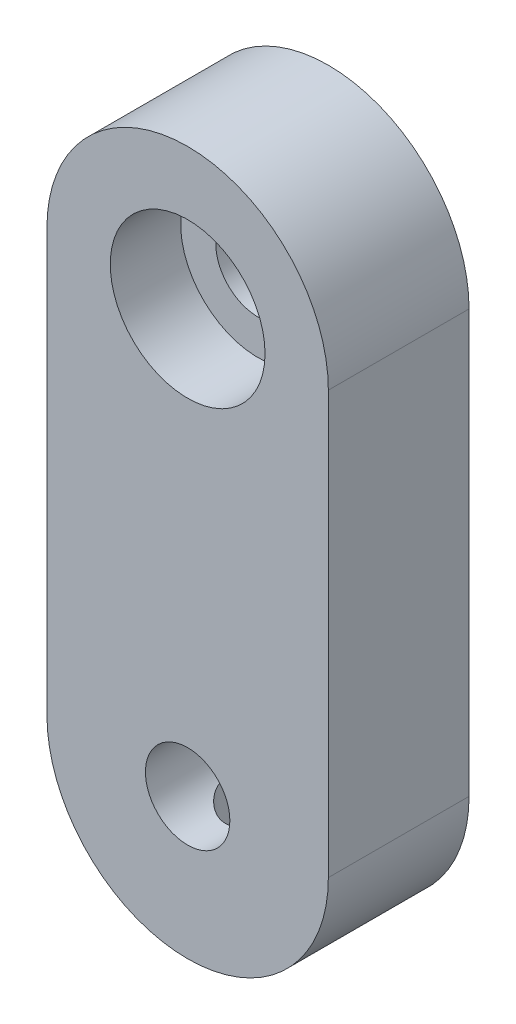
ISO-10303-21;
HEADER;
FILE_DESCRIPTION(('STEP AP214'),'2;1');
FILE_NAME('part.step','',(''),(''),'','','');
FILE_SCHEMA(('AUTOMOTIVE_DESIGN { 1 0 10303 214 1 1 1 1 }'));
ENDSEC;
DATA;
#1=APPLICATION_CONTEXT('core data for automotive mechanical design processes');
#2=APPLICATION_PROTOCOL_DEFINITION('international standard','automotive_design',2000,#1);
#3=PRODUCT_CONTEXT('',#1,'mechanical');
#4=PRODUCT('Part','Part','',(#3));
#5=PRODUCT_RELATED_PRODUCT_CATEGORY('part','',(#4));
#6=PRODUCT_DEFINITION_FORMATION('','',#4);
#7=PRODUCT_DEFINITION_CONTEXT('part definition',#1,'design');
#8=PRODUCT_DEFINITION('design','',#6,#7);
#9=PRODUCT_DEFINITION_SHAPE('','',#8);
#10=(LENGTH_UNIT() NAMED_UNIT(*) SI_UNIT(.MILLI.,.METRE.));
#11=(NAMED_UNIT(*) PLANE_ANGLE_UNIT() SI_UNIT($,.RADIAN.));
#12=(NAMED_UNIT(*) SI_UNIT($,.STERADIAN.) SOLID_ANGLE_UNIT());
#13=UNCERTAINTY_MEASURE_WITH_UNIT(LENGTH_MEASURE(1.E-05),#10,'distance_accuracy_value','');
#14=(GEOMETRIC_REPRESENTATION_CONTEXT(3) GLOBAL_UNCERTAINTY_ASSIGNED_CONTEXT((#13)) GLOBAL_UNIT_ASSIGNED_CONTEXT((#10,
#11,#12)) REPRESENTATION_CONTEXT('',''));
#15=CARTESIAN_POINT('',(0.,0.,0.));
#16=DIRECTION('',(0.,0.,1.));
#17=DIRECTION('',(1.,0.,0.));
#18=AXIS2_PLACEMENT_3D('',#15,#16,#17);
#19=CARTESIAN_POINT('',(0.,30.,10.));
#20=DIRECTION('',(0.,0.,-1.));
#21=DIRECTION('',(-1.,0.,0.));
#22=AXIS2_PLACEMENT_3D('',#19,#20,#21);
#23=CYLINDRICAL_SURFACE('',#22,3.);
#24=CARTESIAN_POINT('',(0.,30.,0.));
#25=DIRECTION('',(0.,0.,1.));
#26=DIRECTION('',(1.,0.,0.));
#27=AXIS2_PLACEMENT_3D('',#24,#25,#26);
#28=CIRCLE('',#27,3.);
#29=CARTESIAN_POINT('',(3.,30.,0.));
#30=VERTEX_POINT('',#29);
#31=EDGE_CURVE('E103',#30,#30,#28,.T.);
#32=ORIENTED_EDGE('',*,*,#31,.F.);
#33=EDGE_LOOP('',(#32));
#34=FACE_BOUND('',#33,.T.);
#35=CARTESIAN_POINT('',(0.,30.,5.));
#36=DIRECTION('',(0.,0.,1.));
#37=DIRECTION('',(1.,0.,0.));
#38=AXIS2_PLACEMENT_3D('',#35,#36,#37);
#39=CIRCLE('',#38,3.);
#40=CARTESIAN_POINT('',(3.,30.,5.));
#41=VERTEX_POINT('',#40);
#42=EDGE_CURVE('E36',#41,#41,#39,.T.);
#43=ORIENTED_EDGE('',*,*,#42,.T.);
#44=EDGE_LOOP('',(#43));
#45=FACE_BOUND('',#44,.T.);
#46=ADVANCED_FACE('F31',(#34,#45),#23,.F.);
#47=CARTESIAN_POINT('',(0.,0.,10.));
#48=DIRECTION('',(0.,0.,1.));
#49=DIRECTION('',(1.,0.,0.));
#50=AXIS2_PLACEMENT_3D('',#47,#48,#49);
#51=PLANE('',#50);
#52=CARTESIAN_POINT('',(0.,30.,10.));
#53=DIRECTION('',(0.,0.,1.));
#54=DIRECTION('',(1.,0.,0.));
#55=AXIS2_PLACEMENT_3D('',#52,#53,#54);
#56=CIRCLE('',#55,5.5);
#57=CARTESIAN_POINT('',(5.5,30.,10.));
#58=VERTEX_POINT('',#57);
#59=EDGE_CURVE('E133',#58,#58,#56,.T.);
#60=ORIENTED_EDGE('',*,*,#59,.F.);
#61=EDGE_LOOP('',(#60));
#62=FACE_BOUND('',#61,.T.);
#63=CARTESIAN_POINT('',(0.,0.,10.));
#64=DIRECTION('',(0.,0.,1.));
#65=DIRECTION('',(1.,0.,0.));
#66=AXIS2_PLACEMENT_3D('',#63,#64,#65);
#67=CIRCLE('',#66,10.);
#68=CARTESIAN_POINT('',(-10.,0.,10.));
#69=VERTEX_POINT('',#68);
#70=CARTESIAN_POINT('',(10.,0.,10.));
#71=VERTEX_POINT('',#70);
#72=EDGE_CURVE('E87',#69,#71,#67,.T.);
#73=ORIENTED_EDGE('',*,*,#72,.T.);
#74=DIRECTION('',(0.,1.,0.));
#75=VECTOR('',#74,1.);
#76=CARTESIAN_POINT('',(10.,0.,10.));
#77=LINE('',#76,#75);
#78=CARTESIAN_POINT('',(10.,30.,10.));
#79=VERTEX_POINT('',#78);
#80=EDGE_CURVE('E81',#71,#79,#77,.T.);
#81=ORIENTED_EDGE('',*,*,#80,.T.);
#82=CARTESIAN_POINT('',(0.,30.,10.));
#83=DIRECTION('',(0.,0.,1.));
#84=DIRECTION('',(1.,0.,0.));
#85=AXIS2_PLACEMENT_3D('',#82,#83,#84);
#86=CIRCLE('',#85,10.);
#87=CARTESIAN_POINT('',(-10.,30.,10.));
#88=VERTEX_POINT('',#87);
#89=EDGE_CURVE('E85',#79,#88,#86,.T.);
#90=ORIENTED_EDGE('',*,*,#89,.T.);
#91=DIRECTION('',(0.,-1.,0.));
#92=VECTOR('',#91,1.);
#93=CARTESIAN_POINT('',(-10.,0.,10.));
#94=LINE('',#93,#92);
#95=EDGE_CURVE('E51',#88,#69,#94,.T.);
#96=ORIENTED_EDGE('',*,*,#95,.T.);
#97=EDGE_LOOP('',(#73,#81,#90,#96));
#98=FACE_BOUND('',#97,.T.);
#99=CARTESIAN_POINT('',(0.,0.,10.));
#100=DIRECTION('',(0.,0.,1.));
#101=DIRECTION('',(1.,0.,0.));
#102=AXIS2_PLACEMENT_3D('',#99,#100,#101);
#103=CIRCLE('',#102,3.);
#104=CARTESIAN_POINT('',(3.,0.,10.));
#105=VERTEX_POINT('',#104);
#106=EDGE_CURVE('E135',#105,#105,#103,.T.);
#107=ORIENTED_EDGE('',*,*,#106,.F.);
#108=EDGE_LOOP('',(#107));
#109=FACE_BOUND('',#108,.T.);
#110=ADVANCED_FACE('F82',(#62,#98,#109),#51,.T.);
#111=CARTESIAN_POINT('',(0.,0.,0.));
#112=DIRECTION('',(0.,0.,1.));
#113=DIRECTION('',(1.,0.,0.));
#114=AXIS2_PLACEMENT_3D('',#111,#112,#113);
#115=PLANE('',#114);
#116=ORIENTED_EDGE('',*,*,#31,.T.);
#117=EDGE_LOOP('',(#116));
#118=FACE_BOUND('',#117,.T.);
#119=CARTESIAN_POINT('',(0.,0.,0.));
#120=DIRECTION('',(0.,0.,1.));
#121=DIRECTION('',(1.,0.,0.));
#122=AXIS2_PLACEMENT_3D('',#119,#120,#121);
#123=CIRCLE('',#122,10.);
#124=CARTESIAN_POINT('',(-10.,0.,0.));
#125=VERTEX_POINT('',#124);
#126=CARTESIAN_POINT('',(10.,0.,0.));
#127=VERTEX_POINT('',#126);
#128=EDGE_CURVE('E100',#125,#127,#123,.T.);
#129=ORIENTED_EDGE('',*,*,#128,.F.);
#130=DIRECTION('',(0.,-1.,0.));
#131=VECTOR('',#130,1.);
#132=CARTESIAN_POINT('',(-10.,0.,0.));
#133=LINE('',#132,#131);
#134=CARTESIAN_POINT('',(-10.,30.,0.));
#135=VERTEX_POINT('',#134);
#136=EDGE_CURVE('E74',#135,#125,#133,.T.);
#137=ORIENTED_EDGE('',*,*,#136,.F.);
#138=CARTESIAN_POINT('',(0.,30.,0.));
#139=DIRECTION('',(0.,0.,1.));
#140=DIRECTION('',(1.,0.,0.));
#141=AXIS2_PLACEMENT_3D('',#138,#139,#140);
#142=CIRCLE('',#141,10.);
#143=CARTESIAN_POINT('',(10.,30.,0.));
#144=VERTEX_POINT('',#143);
#145=EDGE_CURVE('E68',#144,#135,#142,.T.);
#146=ORIENTED_EDGE('',*,*,#145,.F.);
#147=DIRECTION('',(0.,1.,0.));
#148=VECTOR('',#147,1.);
#149=CARTESIAN_POINT('',(10.,0.,0.));
#150=LINE('',#149,#148);
#151=EDGE_CURVE('E91',#127,#144,#150,.T.);
#152=ORIENTED_EDGE('',*,*,#151,.F.);
#153=EDGE_LOOP('',(#129,#137,#146,#152));
#154=FACE_BOUND('',#153,.T.);
#155=CARTESIAN_POINT('',(0.,0.,0.));
#156=DIRECTION('',(0.,0.,1.));
#157=DIRECTION('',(1.,0.,0.));
#158=AXIS2_PLACEMENT_3D('',#155,#156,#157);
#159=CIRCLE('',#158,3.);
#160=CARTESIAN_POINT('',(3.,0.,0.));
#161=VERTEX_POINT('',#160);
#162=EDGE_CURVE('E132',#161,#161,#159,.T.);
#163=ORIENTED_EDGE('',*,*,#162,.T.);
#164=EDGE_LOOP('',(#163));
#165=FACE_BOUND('',#164,.T.);
#166=ADVANCED_FACE('F143',(#118,#154,#165),#115,.F.);
#167=CARTESIAN_POINT('',(0.,0.,10.));
#168=DIRECTION('',(0.,0.,-1.));
#169=DIRECTION('',(-1.,0.,0.));
#170=AXIS2_PLACEMENT_3D('',#167,#168,#169);
#171=CYLINDRICAL_SURFACE('',#170,10.);
#172=CARTESIAN_POINT('',(0.,-10.,7.32507985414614));
#173=CARTESIAN_POINT('',(0.111153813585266,-9.99999795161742,7.32507576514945));
#174=CARTESIAN_POINT('',(0.222359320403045,-9.99812770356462,7.31578216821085));
#175=CARTESIAN_POINT('',(0.441627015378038,-9.99084731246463,7.27888285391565));
#176=CARTESIAN_POINT('',(0.549686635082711,-9.98543435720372,7.25126258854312));
#177=CARTESIAN_POINT('',(0.759460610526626,-9.97167298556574,7.17859730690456));
#178=CARTESIAN_POINT('',(0.861180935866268,-9.96332738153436,7.13356898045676));
#179=CARTESIAN_POINT('',(1.05561597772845,-9.94460796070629,7.02741535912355));
#180=CARTESIAN_POINT('',(1.14833123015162,-9.93423426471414,6.96629102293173));
#181=CARTESIAN_POINT('',(1.32338695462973,-9.9124433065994,6.82880286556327));
#182=CARTESIAN_POINT('',(1.40558790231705,-9.90101491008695,6.75226314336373));
#183=CARTESIAN_POINT('',(1.55607351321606,-9.87848360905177,6.58649502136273));
#184=CARTESIAN_POINT('',(1.62435708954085,-9.86738073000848,6.4972656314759));
#185=CARTESIAN_POINT('',(1.74566350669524,-9.84664883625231,6.30764746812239));
#186=CARTESIAN_POINT('',(1.79854187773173,-9.83703414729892,6.20716456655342));
#187=CARTESIAN_POINT('',(1.88661133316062,-9.82052536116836,5.99851621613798));
#188=CARTESIAN_POINT('',(1.92180416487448,-9.81363099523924,5.89035152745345));
#189=CARTESIAN_POINT('',(1.97305059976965,-9.80345610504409,5.6709111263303));
#190=CARTESIAN_POINT('',(1.98934899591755,-9.80012940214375,5.55969476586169));
#191=CARTESIAN_POINT('',(2.00310425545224,-9.79732750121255,5.33606021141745));
#192=CARTESIAN_POINT('',(2.000563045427,-9.79785190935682,5.22364214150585));
#193=CARTESIAN_POINT('',(1.97690914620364,-9.80265102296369,5.00258627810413));
#194=CARTESIAN_POINT('',(1.95607708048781,-9.80686905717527,4.89391704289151));
#195=CARTESIAN_POINT('',(1.8968757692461,-9.81849092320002,4.68164770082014));
#196=CARTESIAN_POINT('',(1.85850568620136,-9.82589490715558,4.57804783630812));
#197=CARTESIAN_POINT('',(1.76504956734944,-9.84311237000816,4.37804933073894));
#198=CARTESIAN_POINT('',(1.70985230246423,-9.85294179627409,4.2817040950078));
#199=CARTESIAN_POINT('',(1.58438714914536,-9.87389237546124,4.09953815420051));
#200=CARTESIAN_POINT('',(1.51411752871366,-9.88501367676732,4.01371866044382));
#201=CARTESIAN_POINT('',(1.35899986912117,-9.90754042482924,3.85342104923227));
#202=CARTESIAN_POINT('',(1.27391232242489,-9.9189473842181,3.77917471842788));
#203=CARTESIAN_POINT('',(1.09237004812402,-9.94057697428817,3.64597216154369));
#204=CARTESIAN_POINT('',(0.995915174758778,-9.95079958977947,3.58701613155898));
#205=CARTESIAN_POINT('',(0.794118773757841,-9.96893380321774,3.48602483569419));
#206=CARTESIAN_POINT('',(0.688763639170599,-9.97684177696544,3.44401606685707));
#207=CARTESIAN_POINT('',(0.472297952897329,-9.98942817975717,3.37835890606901));
#208=CARTESIAN_POINT('',(0.361188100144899,-9.99410700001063,3.35470828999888));
#209=CARTESIAN_POINT('',(0.138358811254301,-9.99965343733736,3.32676694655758));
#210=CARTESIAN_POINT('',(0.0266806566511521,-10.0005834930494,3.3221590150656));
#211=CARTESIAN_POINT('',(-0.195849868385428,-9.99870103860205,3.3315795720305));
#212=CARTESIAN_POINT('',(-0.306702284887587,-9.99588873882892,3.34560701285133));
#213=CARTESIAN_POINT('',(-0.523411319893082,-9.98687664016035,3.39163660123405));
#214=CARTESIAN_POINT('',(-0.629303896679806,-9.98070752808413,3.42347599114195));
#215=CARTESIAN_POINT('',(-0.834247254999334,-9.96567104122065,3.50404781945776));
#216=CARTESIAN_POINT('',(-0.933297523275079,-9.95680346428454,3.5527815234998));
#217=CARTESIAN_POINT('',(-1.12308234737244,-9.93719823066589,3.66644483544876));
#218=CARTESIAN_POINT('',(-1.21370025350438,-9.92643900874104,3.73156541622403));
#219=CARTESIAN_POINT('',(-1.38283603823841,-9.90429469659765,3.8758982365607));
#220=CARTESIAN_POINT('',(-1.46135261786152,-9.89290953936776,3.95511198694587));
#221=CARTESIAN_POINT('',(-1.60528118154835,-9.8705860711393,4.12682655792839));
#222=CARTESIAN_POINT('',(-1.67047540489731,-9.85965720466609,4.21951134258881));
#223=CARTESIAN_POINT('',(-1.78437084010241,-9.83968383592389,4.4147025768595));
#224=CARTESIAN_POINT('',(-1.83307271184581,-9.83063925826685,4.51720863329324));
#225=CARTESIAN_POINT('',(-1.91230368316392,-9.81553481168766,4.72861634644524));
#226=CARTESIAN_POINT('',(-1.9429269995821,-9.80945949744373,4.83748153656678));
#227=CARTESIAN_POINT('',(-1.98541730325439,-9.80094873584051,5.05894676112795));
#228=CARTESIAN_POINT('',(-1.99728673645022,-9.79851281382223,5.17154630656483));
#229=CARTESIAN_POINT('',(-2.00184182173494,-9.79758299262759,5.39509758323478));
#230=CARTESIAN_POINT('',(-1.99487157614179,-9.79901838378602,5.50604215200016));
#231=CARTESIAN_POINT('',(-1.96270460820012,-9.80551146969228,5.72514315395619));
#232=CARTESIAN_POINT('',(-1.9375080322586,-9.81056913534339,5.83329960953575));
#233=CARTESIAN_POINT('',(-1.86975713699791,-9.82370528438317,6.04353527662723));
#234=CARTESIAN_POINT('',(-1.82724501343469,-9.83177642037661,6.14562857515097));
#235=CARTESIAN_POINT('',(-1.72610928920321,-9.85003429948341,6.34128729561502));
#236=CARTESIAN_POINT('',(-1.66748433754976,-9.86022121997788,6.43485200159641));
#237=CARTESIAN_POINT('',(-1.53461182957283,-9.88177921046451,6.61251099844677));
#238=CARTESIAN_POINT('',(-1.46011577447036,-9.89316745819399,6.69641738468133));
#239=CARTESIAN_POINT('',(-1.29812873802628,-9.91572163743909,6.85065226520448));
#240=CARTESIAN_POINT('',(-1.21063477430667,-9.92688751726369,6.92097763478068));
#241=CARTESIAN_POINT('',(-1.02403525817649,-9.94787664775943,7.04674914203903));
#242=CARTESIAN_POINT('',(-0.92481776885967,-9.95768462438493,7.10203186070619));
#243=CARTESIAN_POINT('',(-0.718332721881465,-9.9747025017,7.19505209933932));
#244=CARTESIAN_POINT('',(-0.611072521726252,-9.98191474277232,7.23280543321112));
#245=CARTESIAN_POINT('',(-0.419642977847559,-9.99152745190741,7.28238375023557));
#246=CARTESIAN_POINT('',(-0.336563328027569,-9.99468606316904,7.29836624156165));
#247=CARTESIAN_POINT('',(-0.168999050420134,-9.99892308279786,7.31971567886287));
#248=CARTESIAN_POINT('',(-0.084514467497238,-10.0000015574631,7.32508296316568));
#249=CARTESIAN_POINT('',(0.,-10.,7.32507985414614));
#250=B_SPLINE_CURVE_WITH_KNOTS('',3,(#172,#173,#174,#175,#176,#177,#178,#179,#180,#181,#182,
#183,#184,#185,#186,#187,#188,#189,#190,#191,#192,#193,#194,#195,#196,#197,#198,#199,#200,#201,
#202,#203,#204,#205,#206,#207,#208,#209,#210,#211,#212,#213,#214,#215,#216,#217,#218,#219,#220,
#221,#222,#223,#224,#225,#226,#227,#228,#229,#230,#231,#232,#233,#234,#235,#236,#237,#238,#239,
#240,#241,#242,#243,#244,#245,#246,#247,#248,#249),.UNSPECIFIED.,.T.,.F.,(4,2,2,2,2,2,2,2,2,2,2,
2,2,2,2,2,2,2,2,2,2,2,2,2,2,2,2,2,2,2,2,2,2,2,2,2,2,2,4),(0.,0.333152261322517,
0.666569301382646,0.999667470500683,1.33274580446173,1.66986534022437,2.00701119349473,
2.34722390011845,2.68740298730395,3.02312370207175,3.3588100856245,3.68943454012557,
4.02007478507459,4.35294980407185,4.68586309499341,5.02476504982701,5.3636713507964,
5.70310549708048,6.04249851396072,6.3762147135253,6.70991215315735,7.04060907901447,
7.37133078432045,7.70610132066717,8.0409077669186,8.38081257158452,8.72070377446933,
9.05880762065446,9.3968673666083,9.72879445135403,10.0607188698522,10.3918392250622,
10.7229873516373,11.0597615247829,11.3966130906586,11.7369899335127,12.0770591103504,
12.3303755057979,12.5836838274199),.UNSPECIFIED.);
#251=CARTESIAN_POINT('',(0.,-10.,7.32507985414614));
#252=VERTEX_POINT('',#251);
#253=EDGE_CURVE('E114',#252,#252,#250,.T.);
#254=ORIENTED_EDGE('',*,*,#253,.T.);
#255=EDGE_LOOP('',(#254));
#256=FACE_BOUND('',#255,.T.);
#257=ORIENTED_EDGE('',*,*,#128,.T.);
#258=DIRECTION('',(0.,0.,-1.));
#259=VECTOR('',#258,1.);
#260=CARTESIAN_POINT('',(10.,0.,10.));
#261=LINE('',#260,#259);
#262=EDGE_CURVE('E11',#71,#127,#261,.T.);
#263=ORIENTED_EDGE('',*,*,#262,.F.);
#264=ORIENTED_EDGE('',*,*,#72,.F.);
#265=DIRECTION('',(0.,0.,-1.));
#266=VECTOR('',#265,1.);
#267=CARTESIAN_POINT('',(-10.,0.,10.));
#268=LINE('',#267,#266);
#269=EDGE_CURVE('E96',#69,#125,#268,.T.);
#270=ORIENTED_EDGE('',*,*,#269,.T.);
#271=EDGE_LOOP('',(#257,#263,#264,#270));
#272=FACE_BOUND('',#271,.T.);
#273=ADVANCED_FACE('F33',(#256,#272),#171,.T.);
#274=CARTESIAN_POINT('',(10.,0.,10.));
#275=DIRECTION('',(-1.,0.,0.));
#276=DIRECTION('',(0.,0.,1.));
#277=AXIS2_PLACEMENT_3D('',#274,#275,#276);
#278=PLANE('',#277);
#279=ORIENTED_EDGE('',*,*,#151,.T.);
#280=DIRECTION('',(0.,0.,-1.));
#281=VECTOR('',#280,1.);
#282=CARTESIAN_POINT('',(10.,30.,10.));
#283=LINE('',#282,#281);
#284=EDGE_CURVE('E42',#79,#144,#283,.T.);
#285=ORIENTED_EDGE('',*,*,#284,.F.);
#286=ORIENTED_EDGE('',*,*,#80,.F.);
#287=ORIENTED_EDGE('',*,*,#262,.T.);
#288=EDGE_LOOP('',(#279,#285,#286,#287));
#289=FACE_BOUND('',#288,.T.);
#290=ADVANCED_FACE('F90',(#289),#278,.F.);
#291=CARTESIAN_POINT('',(0.,30.,10.));
#292=DIRECTION('',(0.,0.,-1.));
#293=DIRECTION('',(-1.,0.,0.));
#294=AXIS2_PLACEMENT_3D('',#291,#292,#293);
#295=CYLINDRICAL_SURFACE('',#294,10.);
#296=ORIENTED_EDGE('',*,*,#145,.T.);
#297=DIRECTION('',(0.,0.,-1.));
#298=VECTOR('',#297,1.);
#299=CARTESIAN_POINT('',(-10.,30.,10.));
#300=LINE('',#299,#298);
#301=EDGE_CURVE('E92',#88,#135,#300,.T.);
#302=ORIENTED_EDGE('',*,*,#301,.F.);
#303=ORIENTED_EDGE('',*,*,#89,.F.);
#304=ORIENTED_EDGE('',*,*,#284,.T.);
#305=EDGE_LOOP('',(#296,#302,#303,#304));
#306=FACE_BOUND('',#305,.T.);
#307=ADVANCED_FACE('F94',(#306),#295,.T.);
#308=CARTESIAN_POINT('',(-10.,0.,10.));
#309=DIRECTION('',(1.,0.,0.));
#310=DIRECTION('',(0.,0.,-1.));
#311=AXIS2_PLACEMENT_3D('',#308,#309,#310);
#312=PLANE('',#311);
#313=ORIENTED_EDGE('',*,*,#136,.T.);
#314=ORIENTED_EDGE('',*,*,#269,.F.);
#315=ORIENTED_EDGE('',*,*,#95,.F.);
#316=ORIENTED_EDGE('',*,*,#301,.T.);
#317=EDGE_LOOP('',(#313,#314,#315,#316));
#318=FACE_BOUND('',#317,.T.);
#319=ADVANCED_FACE('F166',(#318),#312,.F.);
#320=CARTESIAN_POINT('',(0.,0.,10.));
#321=DIRECTION('',(0.,0.,-1.));
#322=DIRECTION('',(-1.,0.,0.));
#323=AXIS2_PLACEMENT_3D('',#320,#321,#322);
#324=CYLINDRICAL_SURFACE('',#323,3.);
#325=CARTESIAN_POINT('',(0.,-3.,7.32507985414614));
#326=CARTESIAN_POINT('',(0.100484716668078,-3.0000004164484,7.32508040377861));
#327=CARTESIAN_POINT('',(0.200969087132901,-2.99490802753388,7.31746588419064));
#328=CARTESIAN_POINT('',(0.398733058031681,-2.97504652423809,7.28748299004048));
#329=CARTESIAN_POINT('',(0.496011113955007,-2.96027281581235,7.26510761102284));
#330=CARTESIAN_POINT('',(0.684212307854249,-2.92250482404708,7.2069721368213));
#331=CARTESIAN_POINT('',(0.775162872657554,-2.89954905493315,7.1712747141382));
#332=CARTESIAN_POINT('',(0.94941529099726,-2.8472613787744,7.08801649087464));
#333=CARTESIAN_POINT('',(1.03271603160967,-2.8179285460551,7.04045396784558));
#334=CARTESIAN_POINT('',(1.19728470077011,-2.75227329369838,6.93042291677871));
#335=CARTESIAN_POINT('',(1.27778030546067,-2.71556897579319,6.86703199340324));
#336=CARTESIAN_POINT('',(1.42772804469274,-2.63982313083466,6.72934980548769));
#337=CARTESIAN_POINT('',(1.49716405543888,-2.60077830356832,6.6550429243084));
#338=CARTESIAN_POINT('',(1.63422297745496,-2.51728264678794,6.48402748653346));
#339=CARTESIAN_POINT('',(1.6998318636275,-2.47295067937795,6.38563420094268));
#340=CARTESIAN_POINT('',(1.81350357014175,-2.3908414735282,6.17671647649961));
#341=CARTESIAN_POINT('',(1.86159673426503,-2.35305295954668,6.0662134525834));
#342=CARTESIAN_POINT('',(1.92674035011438,-2.29976266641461,5.86836856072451));
#343=CARTESIAN_POINT('',(1.94874447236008,-2.28097627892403,5.78355140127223));
#344=CARTESIAN_POINT('',(1.98150617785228,-2.25257969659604,5.61033534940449));
#345=CARTESIAN_POINT('',(1.99228314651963,-2.24295368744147,5.52194290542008));
#346=CARTESIAN_POINT('',(2.00191364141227,-2.23436605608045,5.34360507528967));
#347=CARTESIAN_POINT('',(2.00071842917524,-2.23544802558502,5.25365483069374));
#348=CARTESIAN_POINT('',(1.98637581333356,-2.24819775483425,5.07544488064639));
#349=CARTESIAN_POINT('',(1.97321828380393,-2.25987448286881,4.98718667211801));
#350=CARTESIAN_POINT('',(1.93664994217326,-2.29127185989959,4.81861280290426));
#351=CARTESIAN_POINT('',(1.91371711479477,-2.31061488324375,4.73811851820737));
#352=CARTESIAN_POINT('',(1.85870118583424,-2.35509622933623,4.58205616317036));
#353=CARTESIAN_POINT('',(1.8266150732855,-2.3802364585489,4.50648972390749));
#354=CARTESIAN_POINT('',(1.74673818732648,-2.43964196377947,4.3460544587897));
#355=CARTESIAN_POINT('',(1.69708052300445,-2.47472317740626,4.26241995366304));
#356=CARTESIAN_POINT('',(1.58668960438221,-2.54691537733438,4.10369645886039));
#357=CARTESIAN_POINT('',(1.52594268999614,-2.58402882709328,4.02861819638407));
#358=CARTESIAN_POINT('',(1.37981165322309,-2.66543343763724,3.87253730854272));
#359=CARTESIAN_POINT('',(1.29193938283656,-2.7095474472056,3.79374580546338));
#360=CARTESIAN_POINT('',(1.10200799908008,-2.79218100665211,3.65188335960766));
#361=CARTESIAN_POINT('',(0.999962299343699,-2.83070577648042,3.58879770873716));
#362=CARTESIAN_POINT('',(0.804857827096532,-2.89145404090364,3.49160213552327));
#363=CARTESIAN_POINT('',(0.713957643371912,-2.9153926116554,3.4542364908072));
#364=CARTESIAN_POINT('',(0.526036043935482,-2.95507719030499,3.39297492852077));
#365=CARTESIAN_POINT('',(0.429019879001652,-2.97083012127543,3.36906762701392));
#366=CARTESIAN_POINT('',(0.230985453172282,-2.99275882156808,3.33591868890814));
#367=CARTESIAN_POINT('',(0.129951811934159,-2.99889322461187,3.32674039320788));
#368=CARTESIAN_POINT('',(-0.0724415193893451,-3.00083114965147,3.32383276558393));
#369=CARTESIAN_POINT('',(-0.173801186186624,-2.99663539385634,3.33010235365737));
#370=CARTESIAN_POINT('',(-0.366455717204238,-2.97899589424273,3.35670390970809));
#371=CARTESIAN_POINT('',(-0.457957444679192,-2.96622246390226,3.37601715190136));
#372=CARTESIAN_POINT('',(-0.6361163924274,-2.93318449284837,3.426675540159));
#373=CARTESIAN_POINT('',(-0.722772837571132,-2.91291875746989,3.45802260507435));
#374=CARTESIAN_POINT('',(-0.894664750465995,-2.86496352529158,3.53373215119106));
#375=CARTESIAN_POINT('',(-0.979496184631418,-2.83689870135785,3.57876800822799));
#376=CARTESIAN_POINT('',(-1.14068302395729,-2.77601855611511,3.67951314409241));
#377=CARTESIAN_POINT('',(-1.21703314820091,-2.74320030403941,3.73522901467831));
#378=CARTESIAN_POINT('',(-1.37185445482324,-2.6695454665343,3.86568772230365));
#379=CARTESIAN_POINT('',(-1.44875187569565,-2.62826156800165,3.94204611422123));
#380=CARTESIAN_POINT('',(-1.58933968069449,-2.54571173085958,4.10619128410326));
#381=CARTESIAN_POINT('',(-1.6530209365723,-2.50444582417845,4.19398589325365));
#382=CARTESIAN_POINT('',(-1.76124776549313,-2.4293967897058,4.37222226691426));
#383=CARTESIAN_POINT('',(-1.80695636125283,-2.39527597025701,4.46181188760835));
#384=CARTESIAN_POINT('',(-1.88496213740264,-2.33438974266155,4.64895250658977));
#385=CARTESIAN_POINT('',(-1.91728345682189,-2.30761112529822,4.74648879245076));
#386=CARTESIAN_POINT('',(-1.9623584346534,-2.26933208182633,4.92964434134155));
#387=CARTESIAN_POINT('',(-1.97758597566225,-2.25594998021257,5.01425166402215));
#388=CARTESIAN_POINT('',(-1.99699205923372,-2.23879466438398,5.18565313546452));
#389=CARTESIAN_POINT('',(-2.00118260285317,-2.23501101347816,5.27244480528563));
#390=CARTESIAN_POINT('',(-1.99823921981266,-2.23764201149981,5.44572291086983));
#391=CARTESIAN_POINT('',(-1.99109858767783,-2.24406269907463,5.53220913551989));
#392=CARTESIAN_POINT('',(-1.96596997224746,-2.26610452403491,5.70242338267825));
#393=CARTESIAN_POINT('',(-1.94796751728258,-2.28173793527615,5.78614756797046));
#394=CARTESIAN_POINT('',(-1.89593035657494,-2.32526843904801,5.97079104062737));
#395=CARTESIAN_POINT('',(-1.85890187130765,-2.35532333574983,6.07034756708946));
#396=CARTESIAN_POINT('',(-1.77084526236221,-2.42222161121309,6.26056668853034));
#397=CARTESIAN_POINT('',(-1.71979748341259,-2.45907449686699,6.35121655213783));
#398=CARTESIAN_POINT('',(-1.60398280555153,-2.53617186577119,6.52436174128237));
#399=CARTESIAN_POINT('',(-1.53898309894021,-2.5764658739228,6.60667859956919));
#400=CARTESIAN_POINT('',(-1.39671768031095,-2.65628301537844,6.76040233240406));
#401=CARTESIAN_POINT('',(-1.31944821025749,-2.69580590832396,6.83180585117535));
#402=CARTESIAN_POINT('',(-1.14145732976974,-2.77631551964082,6.97179195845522));
#403=CARTESIAN_POINT('',(-1.03896166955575,-2.81669805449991,7.03849849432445));
#404=CARTESIAN_POINT('',(-0.820868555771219,-2.88777665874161,7.15299313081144));
#405=CARTESIAN_POINT('',(-0.705292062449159,-2.91848793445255,7.20081096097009));
#406=CARTESIAN_POINT('',(-0.491435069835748,-2.96101644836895,7.26623443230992));
#407=CARTESIAN_POINT('',(-0.395012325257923,-2.97551480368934,7.28819089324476));
#408=CARTESIAN_POINT('',(-0.199058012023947,-2.99500280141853,7.31760788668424));
#409=CARTESIAN_POINT('',(-0.0995288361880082,-2.99999958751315,7.32507930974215));
#410=CARTESIAN_POINT('',(0.,-3.,7.32507985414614));
#411=B_SPLINE_CURVE_WITH_KNOTS('',3,(#325,#326,#327,#328,#329,#330,#331,#332,#333,#334,#335,
#336,#337,#338,#339,#340,#341,#342,#343,#344,#345,#346,#347,#348,#349,#350,#351,#352,#353,#354,
#355,#356,#357,#358,#359,#360,#361,#362,#363,#364,#365,#366,#367,#368,#369,#370,#371,#372,#373,
#374,#375,#376,#377,#378,#379,#380,#381,#382,#383,#384,#385,#386,#387,#388,#389,#390,#391,#392,
#393,#394,#395,#396,#397,#398,#399,#400,#401,#402,#403,#404,#405,#406,#407,#408,#409,#410),
.UNSPECIFIED.,.T.,.F.,(4,2,2,2,2,2,2,2,2,2,2,2,2,2,2,2,2,2,2,2,2,2,2,2,2,2,2,2,2,2,2,2,2,2,2,2,
2,2,2,2,2,2,4),(0.,0.301053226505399,0.602249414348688,0.902046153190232,1.20188643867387,
1.52717029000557,1.85292411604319,2.23006683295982,2.60655305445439,2.87433693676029,
3.14165767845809,3.41006711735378,3.67870397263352,3.93548862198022,4.19235783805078,
4.50147574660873,4.81097703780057,5.18718954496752,5.56304840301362,5.86524087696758,
6.16717735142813,6.4704088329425,6.77361911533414,7.05553084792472,7.3374875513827,
7.63652346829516,7.93574454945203,8.28228176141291,8.62905753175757,8.94649935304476,
9.26336626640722,9.52324048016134,9.78283200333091,10.0425772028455,10.302669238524,
10.6320660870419,10.9619271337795,11.2977924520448,11.6337608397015,12.0179535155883,
12.4015390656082,12.6999529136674,12.9981423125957),.UNSPECIFIED.);
#412=CARTESIAN_POINT('',(0.,-3.,7.32507985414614));
#413=VERTEX_POINT('',#412);
#414=EDGE_CURVE('E108',#413,#413,#411,.T.);
#415=ORIENTED_EDGE('',*,*,#414,.F.);
#416=EDGE_LOOP('',(#415));
#417=FACE_BOUND('',#416,.T.);
#418=ORIENTED_EDGE('',*,*,#106,.T.);
#419=EDGE_LOOP('',(#418));
#420=FACE_BOUND('',#419,.T.);
#421=ORIENTED_EDGE('',*,*,#162,.F.);
#422=EDGE_LOOP('',(#421));
#423=FACE_BOUND('',#422,.T.);
#424=ADVANCED_FACE('F115',(#417,#420,#423),#324,.F.);
#425=CARTESIAN_POINT('',(0.,-10.,5.32507985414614));
#426=DIRECTION('',(0.,1.,0.));
#427=DIRECTION('',(0.,0.,1.));
#428=AXIS2_PLACEMENT_3D('',#425,#426,#427);
#429=CYLINDRICAL_SURFACE('',#428,2.);
#430=ORIENTED_EDGE('',*,*,#414,.T.);
#431=EDGE_LOOP('',(#430));
#432=FACE_BOUND('',#431,.T.);
#433=ORIENTED_EDGE('',*,*,#253,.F.);
#434=EDGE_LOOP('',(#433));
#435=FACE_BOUND('',#434,.T.);
#436=ADVANCED_FACE('F118',(#432,#435),#429,.F.);
#437=CARTESIAN_POINT('',(0.,30.,5.));
#438=DIRECTION('',(0.,0.,1.));
#439=DIRECTION('',(1.,0.,0.));
#440=AXIS2_PLACEMENT_3D('',#437,#438,#439);
#441=CYLINDRICAL_SURFACE('',#440,5.5);
#442=CARTESIAN_POINT('',(0.,30.,5.));
#443=DIRECTION('',(0.,0.,1.));
#444=DIRECTION('',(1.,0.,0.));
#445=AXIS2_PLACEMENT_3D('',#442,#443,#444);
#446=CIRCLE('',#445,5.5);
#447=CARTESIAN_POINT('',(5.5,30.,5.));
#448=VERTEX_POINT('',#447);
#449=EDGE_CURVE('E151',#448,#448,#446,.T.);
#450=ORIENTED_EDGE('',*,*,#449,.F.);
#451=EDGE_LOOP('',(#450));
#452=FACE_BOUND('',#451,.T.);
#453=ORIENTED_EDGE('',*,*,#59,.T.);
#454=EDGE_LOOP('',(#453));
#455=FACE_BOUND('',#454,.T.);
#456=ADVANCED_FACE('F122',(#452,#455),#441,.F.);
#457=CARTESIAN_POINT('',(0.,30.,5.));
#458=DIRECTION('',(0.,0.,1.));
#459=DIRECTION('',(1.,0.,0.));
#460=AXIS2_PLACEMENT_3D('',#457,#458,#459);
#461=PLANE('',#460);
#462=ORIENTED_EDGE('',*,*,#42,.F.);
#463=EDGE_LOOP('',(#462));
#464=FACE_BOUND('',#463,.T.);
#465=ORIENTED_EDGE('',*,*,#449,.T.);
#466=EDGE_LOOP('',(#465));
#467=FACE_BOUND('',#466,.T.);
#468=ADVANCED_FACE('F204',(#464,#467),#461,.T.);
#469=CLOSED_SHELL('',(#46,#110,#166,#273,#290,#307,#319,#424,#436,#456,#468));
#470=MANIFOLD_SOLID_BREP('B2',#469);
#471=ADVANCED_BREP_SHAPE_REPRESENTATION('',(#18,#470),#14);
#472=SHAPE_DEFINITION_REPRESENTATION(#9,#471);
ENDSEC;
END-ISO-10303-21;
